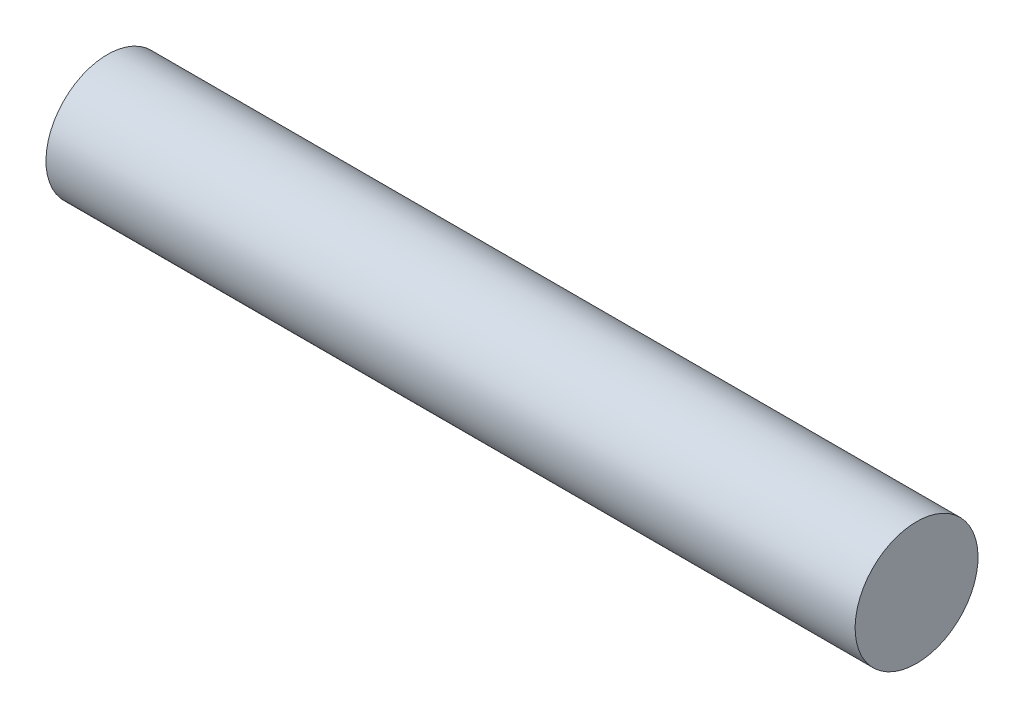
ISO-10303-21;
HEADER;
FILE_DESCRIPTION(('STEP AP214'),'2;1');
FILE_NAME('part.step','',(''),(''),'','','');
FILE_SCHEMA(('AUTOMOTIVE_DESIGN { 1 0 10303 214 1 1 1 1 }'));
ENDSEC;
DATA;
#1=APPLICATION_CONTEXT('core data for automotive mechanical design processes');
#2=APPLICATION_PROTOCOL_DEFINITION('international standard','automotive_design',2000,#1);
#3=PRODUCT_CONTEXT('',#1,'mechanical');
#4=PRODUCT('Part','Part','',(#3));
#5=PRODUCT_RELATED_PRODUCT_CATEGORY('part','',(#4));
#6=PRODUCT_DEFINITION_FORMATION('','',#4);
#7=PRODUCT_DEFINITION_CONTEXT('part definition',#1,'design');
#8=PRODUCT_DEFINITION('design','',#6,#7);
#9=PRODUCT_DEFINITION_SHAPE('','',#8);
#10=(LENGTH_UNIT() NAMED_UNIT(*) SI_UNIT(.MILLI.,.METRE.));
#11=(NAMED_UNIT(*) PLANE_ANGLE_UNIT() SI_UNIT($,.RADIAN.));
#12=(NAMED_UNIT(*) SI_UNIT($,.STERADIAN.) SOLID_ANGLE_UNIT());
#13=UNCERTAINTY_MEASURE_WITH_UNIT(LENGTH_MEASURE(1.E-05),#10,'distance_accuracy_value','');
#14=(GEOMETRIC_REPRESENTATION_CONTEXT(3) GLOBAL_UNCERTAINTY_ASSIGNED_CONTEXT((#13)) GLOBAL_UNIT_ASSIGNED_CONTEXT((#10,
#11,#12)) REPRESENTATION_CONTEXT('',''));
#15=CARTESIAN_POINT('',(0.,0.,0.));
#16=DIRECTION('',(0.,0.,1.));
#17=DIRECTION('',(1.,0.,0.));
#18=AXIS2_PLACEMENT_3D('',#15,#16,#17);
#19=CARTESIAN_POINT('',(106.9975,8.12799999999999,0.));
#20=DIRECTION('',(-1.,0.,0.));
#21=DIRECTION('',(0.,-1.,0.));
#22=AXIS2_PLACEMENT_3D('',#19,#20,#21);
#23=PLANE('',#22);
#24=CARTESIAN_POINT('',(106.9975,0.,0.));
#25=DIRECTION('',(-1.,0.,0.));
#26=DIRECTION('',(0.,-1.,0.));
#27=AXIS2_PLACEMENT_3D('',#24,#25,#26);
#28=CIRCLE('',#27,8.12799999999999);
#29=CARTESIAN_POINT('',(106.9975,-8.12799999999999,0.));
#30=VERTEX_POINT('',#29);
#31=EDGE_CURVE('E10',#30,#30,#28,.T.);
#32=ORIENTED_EDGE('',*,*,#31,.F.);
#33=EDGE_LOOP('',(#32));
#34=FACE_BOUND('',#33,.T.);
#35=ADVANCED_FACE('F31',(#34),#23,.F.);
#36=CARTESIAN_POINT('',(106.9975,0.,0.));
#37=DIRECTION('',(-1.,0.,0.));
#38=DIRECTION('',(0.,-1.,0.));
#39=AXIS2_PLACEMENT_3D('',#36,#37,#38);
#40=CYLINDRICAL_SURFACE('',#39,8.12799999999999);
#41=CARTESIAN_POINT('',(0.,0.,0.));
#42=DIRECTION('',(-1.,0.,0.));
#43=DIRECTION('',(0.,-1.,0.));
#44=AXIS2_PLACEMENT_3D('',#41,#42,#43);
#45=CIRCLE('',#44,8.12799999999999);
#46=CARTESIAN_POINT('',(0.,-8.12799999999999,0.));
#47=VERTEX_POINT('',#46);
#48=EDGE_CURVE('E37',#47,#47,#45,.T.);
#49=ORIENTED_EDGE('',*,*,#48,.F.);
#50=EDGE_LOOP('',(#49));
#51=FACE_BOUND('',#50,.T.);
#52=ORIENTED_EDGE('',*,*,#31,.T.);
#53=EDGE_LOOP('',(#52));
#54=FACE_BOUND('',#53,.T.);
#55=ADVANCED_FACE('F45',(#51,#54),#40,.T.);
#56=CARTESIAN_POINT('',(0.,0.,0.));
#57=DIRECTION('',(1.,0.,0.));
#58=DIRECTION('',(0.,1.,0.));
#59=AXIS2_PLACEMENT_3D('',#56,#57,#58);
#60=PLANE('',#59);
#61=ORIENTED_EDGE('',*,*,#48,.T.);
#62=EDGE_LOOP('',(#61));
#63=FACE_BOUND('',#62,.T.);
#64=ADVANCED_FACE('F43',(#63),#60,.F.);
#65=CLOSED_SHELL('',(#35,#55,#64));
#66=MANIFOLD_SOLID_BREP('B2',#65);
#67=ADVANCED_BREP_SHAPE_REPRESENTATION('',(#18,#66),#14);
#68=SHAPE_DEFINITION_REPRESENTATION(#9,#67);
ENDSEC;
END-ISO-10303-21;
